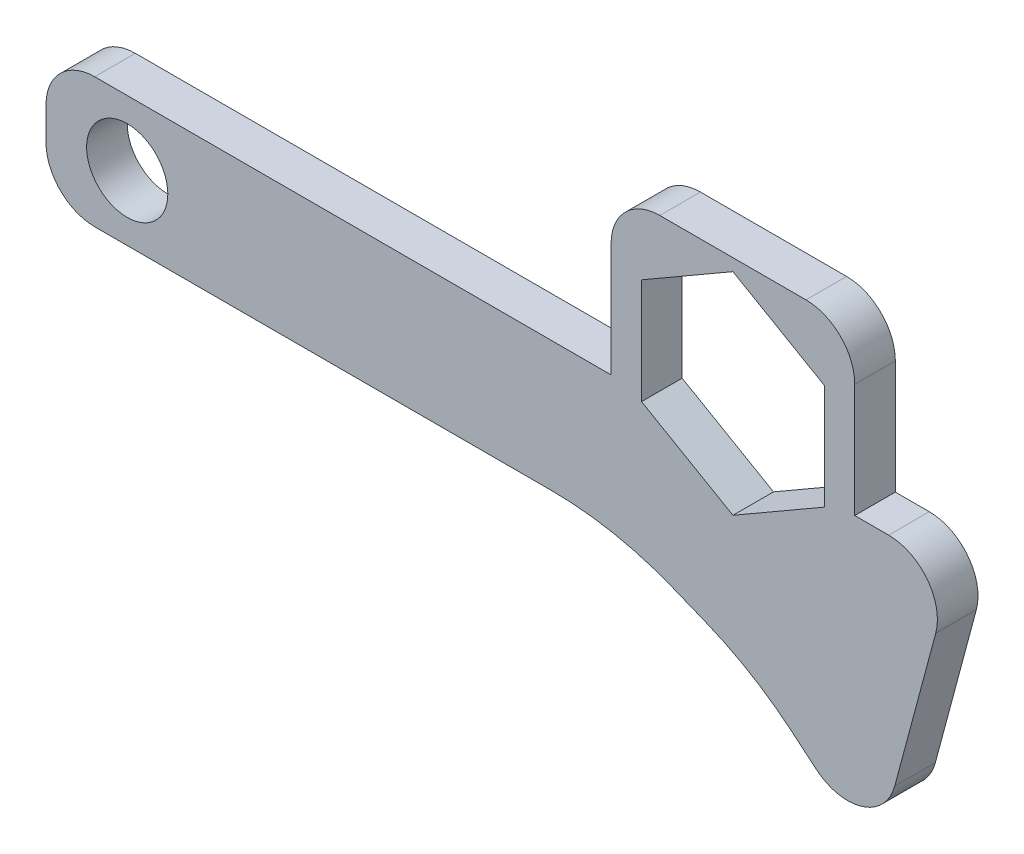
from build123d import *

# Parameters (mm, degrees)
SKETCH1_R           = 3.175
BOSS_EXTRUDE1_DEPTH = 3.175
SKETCH7_W           = 19.05
SKETCH7_H           = 12.7
BOSS_EXTRUDE2_DEPTH = 3.175
FILLET1_R           = 3.81
FILLET2_R           = 25.4
CUT_EXTRUDE1_DEPTH  = 3.175


with BuildPart() as part:
    # Sketch1 → Boss-Extrude1 (new body)
    with BuildSketch(Plane.XY):
        Polygon((64.817405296, -12.377038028), (55.283216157, -4.376903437), (44.45, 0), (0, 0), (0, 10.16), (70.856186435, 10.16), align=None)
        with Locations((6.35, 5.08)):
            Circle(SKETCH1_R, mode=Mode.SUBTRACT)
    extrude(amount=BOSS_EXTRUDE1_DEPTH)

    # Sketch7 → Boss-Extrude2 (add)
    with BuildSketch(Plane.XY):
        with Locations((53.711186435, 16.51)):
            Rectangle(SKETCH7_W, SKETCH7_H)
    extrude(amount=BOSS_EXTRUDE2_DEPTH)

    # Fillet1
    fillet1_edges = [part.edges().sort_by_distance(p)[0] for p in [
        (70.856186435, 10.16, 1.5875),
        (0, 0, 1.5875),
        (0, 10.16, 1.5875),
        (64.817405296, -12.377038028, 1.5875),
        (63.236186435, 22.86, 1.5875),
        (44.186186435, 22.86, 1.5875),
    ]]
    fillet(fillet1_edges, radius=FILLET1_R)

    # Fillet2
    fillet2_edges = [part.edges().sort_by_distance(p)[0] for p in [
        (55.283216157, -4.376903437, 1.5875),
        (44.45, 0, 1.5875),
    ]]
    fillet(fillet2_edges, radius=FILLET2_R)

    # Sketch8 → Cut-Extrude1 (cut)
    with BuildSketch(Plane.XY.offset(3.175)):
        Polygon((60.854936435, 17.787872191), (53.711186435, 21.912318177), (46.567436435, 17.787872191), (46.567436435, 9.53898022), (53.711186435, 5.414534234), (60.854936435, 9.53898022), align=None)
    extrude(amount=-CUT_EXTRUDE1_DEPTH, mode=Mode.SUBTRACT)


solid = part.part
